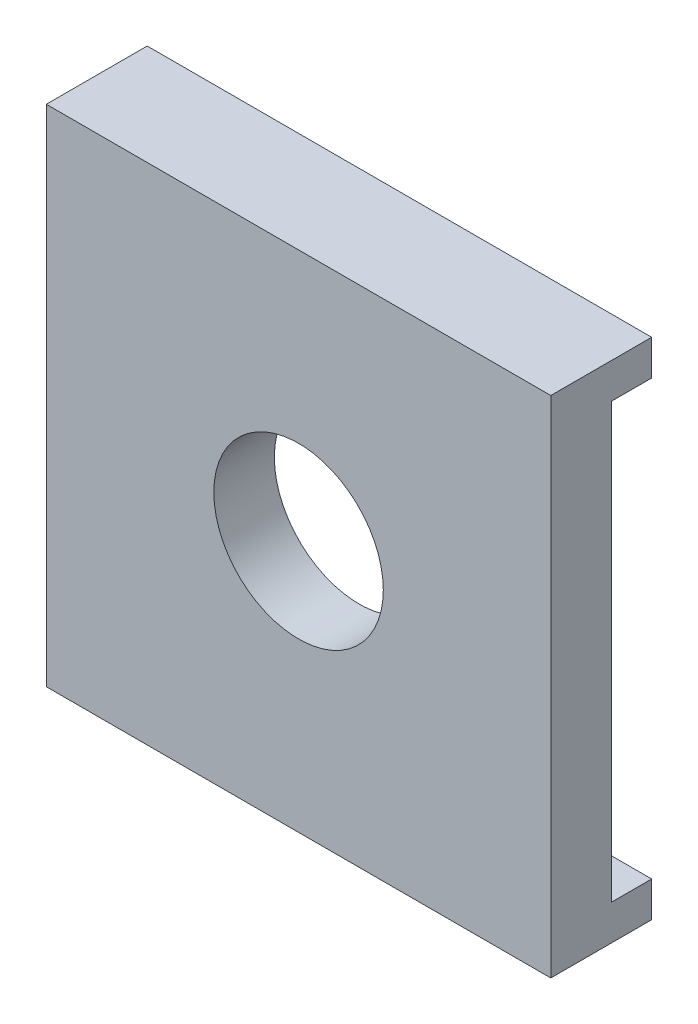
ISO-10303-21;
HEADER;
FILE_DESCRIPTION(('STEP AP214'),'2;1');
FILE_NAME('part.step','',(''),(''),'','','');
FILE_SCHEMA(('AUTOMOTIVE_DESIGN { 1 0 10303 214 1 1 1 1 }'));
ENDSEC;
DATA;
#1=APPLICATION_CONTEXT('core data for automotive mechanical design processes');
#2=APPLICATION_PROTOCOL_DEFINITION('international standard','automotive_design',2000,#1);
#3=PRODUCT_CONTEXT('',#1,'mechanical');
#4=PRODUCT('Part','Part','',(#3));
#5=PRODUCT_RELATED_PRODUCT_CATEGORY('part','',(#4));
#6=PRODUCT_DEFINITION_FORMATION('','',#4);
#7=PRODUCT_DEFINITION_CONTEXT('part definition',#1,'design');
#8=PRODUCT_DEFINITION('design','',#6,#7);
#9=PRODUCT_DEFINITION_SHAPE('','',#8);
#10=(LENGTH_UNIT() NAMED_UNIT(*) SI_UNIT(.MILLI.,.METRE.));
#11=(NAMED_UNIT(*) PLANE_ANGLE_UNIT() SI_UNIT($,.RADIAN.));
#12=(NAMED_UNIT(*) SI_UNIT($,.STERADIAN.) SOLID_ANGLE_UNIT());
#13=UNCERTAINTY_MEASURE_WITH_UNIT(LENGTH_MEASURE(1.E-05),#10,'distance_accuracy_value','');
#14=(GEOMETRIC_REPRESENTATION_CONTEXT(3) GLOBAL_UNCERTAINTY_ASSIGNED_CONTEXT((#13)) GLOBAL_UNIT_ASSIGNED_CONTEXT((#10,
#11,#12)) REPRESENTATION_CONTEXT('',''));
#15=CARTESIAN_POINT('',(0.,0.,0.));
#16=DIRECTION('',(0.,0.,1.));
#17=DIRECTION('',(1.,0.,0.));
#18=AXIS2_PLACEMENT_3D('',#15,#16,#17);
#19=CARTESIAN_POINT('',(0.,0.,-2.));
#20=DIRECTION('',(0.,0.,-1.));
#21=DIRECTION('',(-1.,0.,0.));
#22=AXIS2_PLACEMENT_3D('',#19,#20,#21);
#23=PLANE('',#22);
#24=DIRECTION('',(-1.,0.,0.));
#25=VECTOR('',#24,1.);
#26=CARTESIAN_POINT('',(-12.5,-12.5,-2.));
#27=LINE('',#26,#25);
#28=CARTESIAN_POINT('',(-12.5,-12.5,-2.));
#29=VERTEX_POINT('',#28);
#30=CARTESIAN_POINT('',(12.5,-12.5,-2.));
#31=VERTEX_POINT('',#30);
#32=EDGE_CURVE('E89',#29,#31,#27,.F.);
#33=ORIENTED_EDGE('',*,*,#32,.F.);
#34=DIRECTION('',(0.,1.,0.));
#35=VECTOR('',#34,1.);
#36=CARTESIAN_POINT('',(-12.5,12.5,-2.));
#37=LINE('',#36,#35);
#38=CARTESIAN_POINT('',(-12.5,-10.75,-2.));
#39=VERTEX_POINT('',#38);
#40=EDGE_CURVE('E86',#39,#29,#37,.F.);
#41=ORIENTED_EDGE('',*,*,#40,.F.);
#42=DIRECTION('',(-1.,0.,0.));
#43=VECTOR('',#42,1.);
#44=CARTESIAN_POINT('',(12.5,-10.75,-2.));
#45=LINE('',#44,#43);
#46=CARTESIAN_POINT('',(12.5,-10.75,-2.));
#47=VERTEX_POINT('',#46);
#48=EDGE_CURVE('E80',#47,#39,#45,.T.);
#49=ORIENTED_EDGE('',*,*,#48,.F.);
#50=DIRECTION('',(0.,1.,0.));
#51=VECTOR('',#50,1.);
#52=CARTESIAN_POINT('',(12.5,-12.5,-2.));
#53=LINE('',#52,#51);
#54=EDGE_CURVE('E83',#31,#47,#53,.T.);
#55=ORIENTED_EDGE('',*,*,#54,.F.);
#56=EDGE_LOOP('',(#33,#41,#49,#55));
#57=FACE_BOUND('',#56,.T.);
#58=ADVANCED_FACE('F14',(#57),#23,.T.);
#59=CARTESIAN_POINT('',(0.,0.,-2.));
#60=DIRECTION('',(0.,0.,-1.));
#61=DIRECTION('',(-1.,0.,0.));
#62=AXIS2_PLACEMENT_3D('',#59,#60,#61);
#63=PLANE('',#62);
#64=DIRECTION('',(-1.,0.,0.));
#65=VECTOR('',#64,1.);
#66=CARTESIAN_POINT('',(12.5,12.5,-2.));
#67=LINE('',#66,#65);
#68=CARTESIAN_POINT('',(12.5,12.5,-2.));
#69=VERTEX_POINT('',#68);
#70=CARTESIAN_POINT('',(-12.5,12.5,-2.));
#71=VERTEX_POINT('',#70);
#72=EDGE_CURVE('E104',#69,#71,#67,.T.);
#73=ORIENTED_EDGE('',*,*,#72,.F.);
#74=DIRECTION('',(0.,1.,0.));
#75=VECTOR('',#74,1.);
#76=CARTESIAN_POINT('',(12.5,-12.5,-2.));
#77=LINE('',#76,#75);
#78=CARTESIAN_POINT('',(12.5,10.75,-2.));
#79=VERTEX_POINT('',#78);
#80=EDGE_CURVE('E108',#79,#69,#77,.T.);
#81=ORIENTED_EDGE('',*,*,#80,.F.);
#82=DIRECTION('',(-1.,0.,0.));
#83=VECTOR('',#82,1.);
#84=CARTESIAN_POINT('',(-12.5,10.75,-2.));
#85=LINE('',#84,#83);
#86=CARTESIAN_POINT('',(-12.5,10.75,-2.));
#87=VERTEX_POINT('',#86);
#88=EDGE_CURVE('E74',#87,#79,#85,.F.);
#89=ORIENTED_EDGE('',*,*,#88,.F.);
#90=DIRECTION('',(0.,1.,0.));
#91=VECTOR('',#90,1.);
#92=CARTESIAN_POINT('',(-12.5,12.5,-2.));
#93=LINE('',#92,#91);
#94=EDGE_CURVE('E143',#71,#87,#93,.F.);
#95=ORIENTED_EDGE('',*,*,#94,.F.);
#96=EDGE_LOOP('',(#73,#81,#89,#95));
#97=FACE_BOUND('',#96,.T.);
#98=ADVANCED_FACE('F141',(#97),#63,.T.);
#99=CARTESIAN_POINT('',(-12.5,10.75,-2.));
#100=DIRECTION('',(0.,-1.,0.));
#101=DIRECTION('',(0.,0.,1.));
#102=AXIS2_PLACEMENT_3D('',#99,#100,#101);
#103=PLANE('',#102);
#104=ORIENTED_EDGE('',*,*,#88,.T.);
#105=DIRECTION('',(0.,0.,-1.));
#106=VECTOR('',#105,1.);
#107=CARTESIAN_POINT('',(12.5,10.75,3.));
#108=LINE('',#107,#106);
#109=CARTESIAN_POINT('',(12.5,10.75,0.));
#110=VERTEX_POINT('',#109);
#111=EDGE_CURVE('E99',#110,#79,#108,.T.);
#112=ORIENTED_EDGE('',*,*,#111,.F.);
#113=DIRECTION('',(-1.,0.,0.));
#114=VECTOR('',#113,1.);
#115=CARTESIAN_POINT('',(0.,10.75,0.));
#116=LINE('',#115,#114);
#117=CARTESIAN_POINT('',(-12.5,10.75,0.));
#118=VERTEX_POINT('',#117);
#119=EDGE_CURVE('E152',#118,#110,#116,.F.);
#120=ORIENTED_EDGE('',*,*,#119,.F.);
#121=DIRECTION('',(0.,0.,1.));
#122=VECTOR('',#121,1.);
#123=CARTESIAN_POINT('',(-12.5,10.75,3.));
#124=LINE('',#123,#122);
#125=EDGE_CURVE('E144',#87,#118,#124,.T.);
#126=ORIENTED_EDGE('',*,*,#125,.F.);
#127=EDGE_LOOP('',(#104,#112,#120,#126));
#128=FACE_BOUND('',#127,.T.);
#129=ADVANCED_FACE('F173',(#128),#103,.T.);
#130=CARTESIAN_POINT('',(12.5,-10.75,-2.));
#131=DIRECTION('',(0.,1.,0.));
#132=DIRECTION('',(0.,0.,-1.));
#133=AXIS2_PLACEMENT_3D('',#130,#131,#132);
#134=PLANE('',#133);
#135=ORIENTED_EDGE('',*,*,#48,.T.);
#136=DIRECTION('',(0.,0.,1.));
#137=VECTOR('',#136,1.);
#138=CARTESIAN_POINT('',(-12.5,-10.75,3.));
#139=LINE('',#138,#137);
#140=CARTESIAN_POINT('',(-12.5,-10.75,0.));
#141=VERTEX_POINT('',#140);
#142=EDGE_CURVE('E129',#141,#39,#139,.F.);
#143=ORIENTED_EDGE('',*,*,#142,.F.);
#144=DIRECTION('',(-1.,0.,0.));
#145=VECTOR('',#144,1.);
#146=CARTESIAN_POINT('',(0.,-10.75,0.));
#147=LINE('',#146,#145);
#148=CARTESIAN_POINT('',(12.5,-10.75,0.));
#149=VERTEX_POINT('',#148);
#150=EDGE_CURVE('E95',#149,#141,#147,.T.);
#151=ORIENTED_EDGE('',*,*,#150,.F.);
#152=DIRECTION('',(0.,0.,-1.));
#153=VECTOR('',#152,1.);
#154=CARTESIAN_POINT('',(12.5,-10.75,3.));
#155=LINE('',#154,#153);
#156=EDGE_CURVE('E92',#47,#149,#155,.F.);
#157=ORIENTED_EDGE('',*,*,#156,.F.);
#158=EDGE_LOOP('',(#135,#143,#151,#157));
#159=FACE_BOUND('',#158,.T.);
#160=ADVANCED_FACE('F93',(#159),#134,.T.);
#161=CARTESIAN_POINT('',(-12.5,-12.5,3.));
#162=DIRECTION('',(0.,-1.,0.));
#163=DIRECTION('',(0.,0.,1.));
#164=AXIS2_PLACEMENT_3D('',#161,#162,#163);
#165=PLANE('',#164);
#166=DIRECTION('',(1.,0.,0.));
#167=VECTOR('',#166,1.);
#168=CARTESIAN_POINT('',(0.,-12.5,3.));
#169=LINE('',#168,#167);
#170=CARTESIAN_POINT('',(-12.5,-12.5,3.));
#171=VERTEX_POINT('',#170);
#172=CARTESIAN_POINT('',(12.5,-12.5,3.));
#173=VERTEX_POINT('',#172);
#174=EDGE_CURVE('E123',#171,#173,#169,.T.);
#175=ORIENTED_EDGE('',*,*,#174,.F.);
#176=DIRECTION('',(0.,0.,1.));
#177=VECTOR('',#176,1.);
#178=CARTESIAN_POINT('',(-12.5,-12.5,3.));
#179=LINE('',#178,#177);
#180=EDGE_CURVE('E121',#29,#171,#179,.T.);
#181=ORIENTED_EDGE('',*,*,#180,.F.);
#182=ORIENTED_EDGE('',*,*,#32,.T.);
#183=DIRECTION('',(0.,0.,-1.));
#184=VECTOR('',#183,1.);
#185=CARTESIAN_POINT('',(12.5,-12.5,3.));
#186=LINE('',#185,#184);
#187=EDGE_CURVE('E103',#173,#31,#186,.T.);
#188=ORIENTED_EDGE('',*,*,#187,.F.);
#189=EDGE_LOOP('',(#175,#181,#182,#188));
#190=FACE_BOUND('',#189,.T.);
#191=ADVANCED_FACE('F119',(#190),#165,.T.);
#192=CARTESIAN_POINT('',(12.5,-12.5,3.));
#193=DIRECTION('',(1.,0.,0.));
#194=DIRECTION('',(0.,0.,-1.));
#195=AXIS2_PLACEMENT_3D('',#192,#193,#194);
#196=PLANE('',#195);
#197=ORIENTED_EDGE('',*,*,#187,.T.);
#198=ORIENTED_EDGE('',*,*,#54,.T.);
#199=ORIENTED_EDGE('',*,*,#156,.T.);
#200=DIRECTION('',(0.,1.,0.));
#201=VECTOR('',#200,1.);
#202=CARTESIAN_POINT('',(12.5,0.,0.));
#203=LINE('',#202,#201);
#204=EDGE_CURVE('E155',#110,#149,#203,.F.);
#205=ORIENTED_EDGE('',*,*,#204,.F.);
#206=ORIENTED_EDGE('',*,*,#111,.T.);
#207=ORIENTED_EDGE('',*,*,#80,.T.);
#208=DIRECTION('',(0.,0.,-1.));
#209=VECTOR('',#208,1.);
#210=CARTESIAN_POINT('',(12.5,12.5,3.));
#211=LINE('',#210,#209);
#212=CARTESIAN_POINT('',(12.5,12.5,3.));
#213=VERTEX_POINT('',#212);
#214=EDGE_CURVE('E106',#213,#69,#211,.T.);
#215=ORIENTED_EDGE('',*,*,#214,.F.);
#216=DIRECTION('',(0.,1.,0.));
#217=VECTOR('',#216,1.);
#218=CARTESIAN_POINT('',(12.5,0.,3.));
#219=LINE('',#218,#217);
#220=EDGE_CURVE('E139',#173,#213,#219,.T.);
#221=ORIENTED_EDGE('',*,*,#220,.F.);
#222=EDGE_LOOP('',(#197,#198,#199,#205,#206,#207,#215,#221));
#223=FACE_BOUND('',#222,.T.);
#224=ADVANCED_FACE('F101',(#223),#196,.T.);
#225=CARTESIAN_POINT('',(12.5,12.5,3.));
#226=DIRECTION('',(0.,1.,0.));
#227=DIRECTION('',(0.,0.,-1.));
#228=AXIS2_PLACEMENT_3D('',#225,#226,#227);
#229=PLANE('',#228);
#230=DIRECTION('',(1.,0.,0.));
#231=VECTOR('',#230,1.);
#232=CARTESIAN_POINT('',(0.,12.5,3.));
#233=LINE('',#232,#231);
#234=CARTESIAN_POINT('',(-12.5,12.5,3.));
#235=VERTEX_POINT('',#234);
#236=EDGE_CURVE('E137',#213,#235,#233,.F.);
#237=ORIENTED_EDGE('',*,*,#236,.F.);
#238=ORIENTED_EDGE('',*,*,#214,.T.);
#239=ORIENTED_EDGE('',*,*,#72,.T.);
#240=DIRECTION('',(0.,0.,1.));
#241=VECTOR('',#240,1.);
#242=CARTESIAN_POINT('',(-12.5,12.5,3.));
#243=LINE('',#242,#241);
#244=EDGE_CURVE('E31',#235,#71,#243,.F.);
#245=ORIENTED_EDGE('',*,*,#244,.F.);
#246=EDGE_LOOP('',(#237,#238,#239,#245));
#247=FACE_BOUND('',#246,.T.);
#248=ADVANCED_FACE('F134',(#247),#229,.T.);
#249=CARTESIAN_POINT('',(-12.5,12.5,3.));
#250=DIRECTION('',(-1.,0.,0.));
#251=DIRECTION('',(0.,0.,1.));
#252=AXIS2_PLACEMENT_3D('',#249,#250,#251);
#253=PLANE('',#252);
#254=ORIENTED_EDGE('',*,*,#125,.T.);
#255=DIRECTION('',(0.,1.,0.));
#256=VECTOR('',#255,1.);
#257=CARTESIAN_POINT('',(-12.5,0.,0.));
#258=LINE('',#257,#256);
#259=EDGE_CURVE('E149',#141,#118,#258,.T.);
#260=ORIENTED_EDGE('',*,*,#259,.F.);
#261=ORIENTED_EDGE('',*,*,#142,.T.);
#262=ORIENTED_EDGE('',*,*,#40,.T.);
#263=ORIENTED_EDGE('',*,*,#180,.T.);
#264=DIRECTION('',(0.,1.,0.));
#265=VECTOR('',#264,1.);
#266=CARTESIAN_POINT('',(-12.5,0.,3.));
#267=LINE('',#266,#265);
#268=EDGE_CURVE('E146',#235,#171,#267,.F.);
#269=ORIENTED_EDGE('',*,*,#268,.F.);
#270=ORIENTED_EDGE('',*,*,#244,.T.);
#271=ORIENTED_EDGE('',*,*,#94,.T.);
#272=EDGE_LOOP('',(#254,#260,#261,#262,#263,#269,#270,#271));
#273=FACE_BOUND('',#272,.T.);
#274=ADVANCED_FACE('F127',(#273),#253,.T.);
#275=CARTESIAN_POINT('',(0.,0.,0.));
#276=DIRECTION('',(0.,0.,-1.));
#277=DIRECTION('',(-1.,0.,0.));
#278=AXIS2_PLACEMENT_3D('',#275,#276,#277);
#279=PLANE('',#278);
#280=CARTESIAN_POINT('',(0.,0.,0.));
#281=DIRECTION('',(0.,0.,-1.));
#282=DIRECTION('',(-1.,0.,0.));
#283=AXIS2_PLACEMENT_3D('',#280,#281,#282);
#284=CIRCLE('',#283,4.2);
#285=CARTESIAN_POINT('',(-4.2,0.,0.));
#286=VERTEX_POINT('',#285);
#287=EDGE_CURVE('E18',#286,#286,#284,.T.);
#288=ORIENTED_EDGE('',*,*,#287,.F.);
#289=EDGE_LOOP('',(#288));
#290=FACE_BOUND('',#289,.T.);
#291=ORIENTED_EDGE('',*,*,#204,.T.);
#292=ORIENTED_EDGE('',*,*,#150,.T.);
#293=ORIENTED_EDGE('',*,*,#259,.T.);
#294=ORIENTED_EDGE('',*,*,#119,.T.);
#295=EDGE_LOOP('',(#291,#292,#293,#294));
#296=FACE_BOUND('',#295,.T.);
#297=ADVANCED_FACE('F167',(#290,#296),#279,.T.);
#298=CARTESIAN_POINT('',(0.,0.,3.));
#299=DIRECTION('',(0.,0.,1.));
#300=DIRECTION('',(1.,0.,0.));
#301=AXIS2_PLACEMENT_3D('',#298,#299,#300);
#302=PLANE('',#301);
#303=CARTESIAN_POINT('',(0.,0.,3.));
#304=DIRECTION('',(0.,0.,-1.));
#305=DIRECTION('',(-1.,0.,0.));
#306=AXIS2_PLACEMENT_3D('',#303,#304,#305);
#307=CIRCLE('',#306,4.2);
#308=CARTESIAN_POINT('',(-4.2,0.,3.));
#309=VERTEX_POINT('',#308);
#310=EDGE_CURVE('E9',#309,#309,#307,.F.);
#311=ORIENTED_EDGE('',*,*,#310,.F.);
#312=EDGE_LOOP('',(#311));
#313=FACE_BOUND('',#312,.T.);
#314=ORIENTED_EDGE('',*,*,#236,.T.);
#315=ORIENTED_EDGE('',*,*,#268,.T.);
#316=ORIENTED_EDGE('',*,*,#174,.T.);
#317=ORIENTED_EDGE('',*,*,#220,.T.);
#318=EDGE_LOOP('',(#314,#315,#316,#317));
#319=FACE_BOUND('',#318,.T.);
#320=ADVANCED_FACE('F170',(#313,#319),#302,.T.);
#321=CARTESIAN_POINT('',(0.,0.,3.));
#322=DIRECTION('',(0.,0.,-1.));
#323=DIRECTION('',(-1.,0.,0.));
#324=AXIS2_PLACEMENT_3D('',#321,#322,#323);
#325=CYLINDRICAL_SURFACE('',#324,4.2);
#326=ORIENTED_EDGE('',*,*,#287,.T.);
#327=EDGE_LOOP('',(#326));
#328=FACE_BOUND('',#327,.T.);
#329=ORIENTED_EDGE('',*,*,#310,.T.);
#330=EDGE_LOOP('',(#329));
#331=FACE_BOUND('',#330,.T.);
#332=ADVANCED_FACE('F16',(#328,#331),#325,.F.);
#333=CLOSED_SHELL('',(#58,#98,#129,#160,#191,#224,#248,#274,#297,#320,#332));
#334=MANIFOLD_SOLID_BREP('B1',#333);
#335=ADVANCED_BREP_SHAPE_REPRESENTATION('',(#18,#334),#14);
#336=SHAPE_DEFINITION_REPRESENTATION(#9,#335);
ENDSEC;
END-ISO-10303-21;
